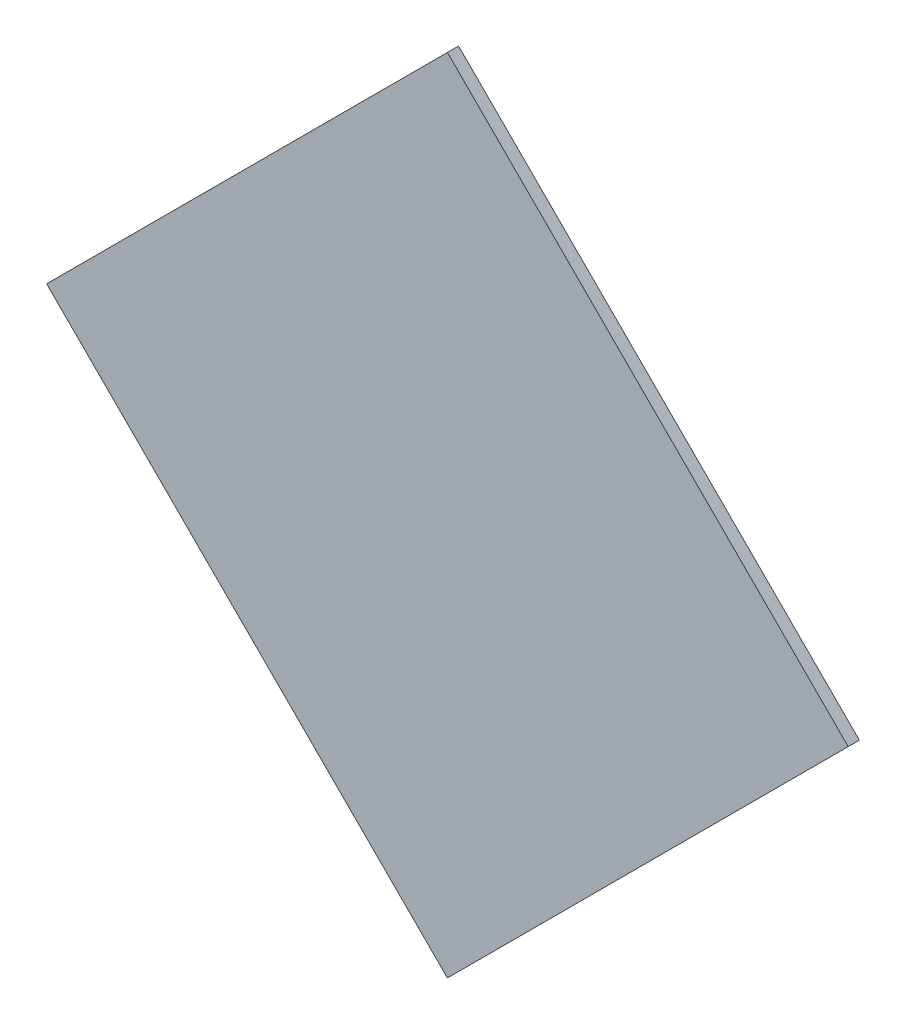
ISO-10303-21;
HEADER;
FILE_DESCRIPTION(('STEP AP214'),'2;1');
FILE_NAME('part.step','',(''),(''),'','','');
FILE_SCHEMA(('AUTOMOTIVE_DESIGN { 1 0 10303 214 1 1 1 1 }'));
ENDSEC;
DATA;
#1=APPLICATION_CONTEXT('core data for automotive mechanical design processes');
#2=APPLICATION_PROTOCOL_DEFINITION('international standard','automotive_design',2000,#1);
#3=PRODUCT_CONTEXT('',#1,'mechanical');
#4=PRODUCT('Part','Part','',(#3));
#5=PRODUCT_RELATED_PRODUCT_CATEGORY('part','',(#4));
#6=PRODUCT_DEFINITION_FORMATION('','',#4);
#7=PRODUCT_DEFINITION_CONTEXT('part definition',#1,'design');
#8=PRODUCT_DEFINITION('design','',#6,#7);
#9=PRODUCT_DEFINITION_SHAPE('','',#8);
#10=(LENGTH_UNIT() NAMED_UNIT(*) SI_UNIT(.MILLI.,.METRE.));
#11=(NAMED_UNIT(*) PLANE_ANGLE_UNIT() SI_UNIT($,.RADIAN.));
#12=(NAMED_UNIT(*) SI_UNIT($,.STERADIAN.) SOLID_ANGLE_UNIT());
#13=UNCERTAINTY_MEASURE_WITH_UNIT(LENGTH_MEASURE(1.E-05),#10,'distance_accuracy_value','');
#14=(GEOMETRIC_REPRESENTATION_CONTEXT(3) GLOBAL_UNCERTAINTY_ASSIGNED_CONTEXT((#13)) GLOBAL_UNIT_ASSIGNED_CONTEXT((#10,
#11,#12)) REPRESENTATION_CONTEXT('',''));
#15=CARTESIAN_POINT('',(0.,0.,0.));
#16=DIRECTION('',(0.,0.,1.));
#17=DIRECTION('',(1.,0.,0.));
#18=AXIS2_PLACEMENT_3D('',#15,#16,#17);
#19=CARTESIAN_POINT('',(5.079999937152E-06,0.3592068,0.));
#20=DIRECTION('',(0.707109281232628,0.707104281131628,0.));
#21=DIRECTION('',(0.,0.,-1.));
#22=AXIS2_PLACEMENT_3D('',#19,#20,#21);
#23=PLANE('',#22);
#24=DIRECTION('',(0.,0.,1.));
#25=VECTOR('',#24,1.);
#26=CARTESIAN_POINT('',(5.079999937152E-06,0.3592068,0.));
#27=LINE('',#26,#25);
#28=CARTESIAN_POINT('',(5.079999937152E-06,0.3592068,0.));
#29=VERTEX_POINT('',#28);
#30=CARTESIAN_POINT('',(5.079999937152E-06,0.3592068,0.00999998));
#31=VERTEX_POINT('',#30);
#32=EDGE_CURVE('E11',#29,#31,#27,.T.);
#33=ORIENTED_EDGE('',*,*,#32,.T.);
#34=DIRECTION('',(0.707104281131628,-0.707109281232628,0.));
#35=VECTOR('',#34,1.);
#36=CARTESIAN_POINT('',(5.079999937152E-06,0.3592068,0.00999998));
#37=LINE('',#36,#35);
#38=CARTESIAN_POINT('',(0.3592068,2.540000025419E-06,0.00999998));
#39=VERTEX_POINT('',#38);
#40=EDGE_CURVE('E44',#31,#39,#37,.T.);
#41=ORIENTED_EDGE('',*,*,#40,.T.);
#42=DIRECTION('',(0.,0.,1.));
#43=VECTOR('',#42,1.);
#44=CARTESIAN_POINT('',(0.3592068,2.540000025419E-06,0.));
#45=LINE('',#44,#43);
#46=CARTESIAN_POINT('',(0.3592068,2.540000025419E-06,0.));
#47=VERTEX_POINT('',#46);
#48=EDGE_CURVE('E78',#47,#39,#45,.T.);
#49=ORIENTED_EDGE('',*,*,#48,.F.);
#50=DIRECTION('',(0.707104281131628,-0.707109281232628,0.));
#51=VECTOR('',#50,1.);
#52=CARTESIAN_POINT('',(5.079999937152E-06,0.3592068,0.));
#53=LINE('',#52,#51);
#54=EDGE_CURVE('E108',#29,#47,#53,.T.);
#55=ORIENTED_EDGE('',*,*,#54,.F.);
#56=EDGE_LOOP('',(#33,#41,#49,#55));
#57=FACE_BOUND('',#56,.T.);
#58=ADVANCED_FACE('F17',(#57),#23,.T.);
#59=CARTESIAN_POINT('',(-0.35920426,0.,0.));
#60=DIRECTION('',(-0.707104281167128,0.707109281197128,0.));
#61=DIRECTION('',(0.,0.,1.));
#62=AXIS2_PLACEMENT_3D('',#59,#60,#61);
#63=PLANE('',#62);
#64=DIRECTION('',(0.,0.,1.));
#65=VECTOR('',#64,1.);
#66=CARTESIAN_POINT('',(-0.35920426,0.,0.));
#67=LINE('',#66,#65);
#68=CARTESIAN_POINT('',(-0.35920426,0.,0.));
#69=VERTEX_POINT('',#68);
#70=CARTESIAN_POINT('',(-0.35920426,0.,0.00999998));
#71=VERTEX_POINT('',#70);
#72=EDGE_CURVE('E89',#69,#71,#67,.T.);
#73=ORIENTED_EDGE('',*,*,#72,.T.);
#74=DIRECTION('',(0.707109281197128,0.707104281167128,0.));
#75=VECTOR('',#74,1.);
#76=CARTESIAN_POINT('',(-0.35920426,0.,0.00999998));
#77=LINE('',#76,#75);
#78=EDGE_CURVE('E25',#71,#31,#77,.T.);
#79=ORIENTED_EDGE('',*,*,#78,.T.);
#80=ORIENTED_EDGE('',*,*,#32,.F.);
#81=DIRECTION('',(0.707109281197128,0.707104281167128,0.));
#82=VECTOR('',#81,1.);
#83=CARTESIAN_POINT('',(-0.35920426,0.,0.));
#84=LINE('',#83,#82);
#85=EDGE_CURVE('E102',#69,#29,#84,.T.);
#86=ORIENTED_EDGE('',*,*,#85,.F.);
#87=EDGE_LOOP('',(#73,#79,#80,#86));
#88=FACE_BOUND('',#87,.T.);
#89=ADVANCED_FACE('F123',(#88),#63,.T.);
#90=CARTESIAN_POINT('',(1.90500109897E-06,3.17496656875E-07,0.00999998));
#91=DIRECTION('',(0.,0.,-1.));
#92=DIRECTION('',(0.,-1.,0.));
#93=AXIS2_PLACEMENT_3D('',#90,#91,#92);
#94=PLANE('',#93);
#95=DIRECTION('',(-0.70710178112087,-0.70711178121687,0.));
#96=VECTOR('',#95,1.);
#97=CARTESIAN_POINT('',(0.3592068,2.540000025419E-06,0.00999998));
#98=LINE('',#97,#96);
#99=CARTESIAN_POINT('',(2.539999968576E-06,-0.3592068,0.00999998));
#100=VERTEX_POINT('',#99);
#101=EDGE_CURVE('E72',#39,#100,#98,.T.);
#102=ORIENTED_EDGE('',*,*,#101,.F.);
#103=ORIENTED_EDGE('',*,*,#40,.F.);
#104=ORIENTED_EDGE('',*,*,#78,.F.);
#105=DIRECTION('',(-0.707106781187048,0.707106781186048,0.));
#106=VECTOR('',#105,1.);
#107=CARTESIAN_POINT('',(2.539999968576E-06,-0.3592068,0.00999998));
#108=LINE('',#107,#106);
#109=EDGE_CURVE('E83',#100,#71,#108,.T.);
#110=ORIENTED_EDGE('',*,*,#109,.F.);
#111=EDGE_LOOP('',(#102,#103,#104,#110));
#112=FACE_BOUND('',#111,.T.);
#113=ADVANCED_FACE('F84',(#112),#94,.F.);
#114=CARTESIAN_POINT('',(0.3592068,2.540000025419E-06,0.));
#115=DIRECTION('',(0.70711178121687,-0.70710178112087,0.));
#116=DIRECTION('',(0.,0.,-1.));
#117=AXIS2_PLACEMENT_3D('',#114,#115,#116);
#118=PLANE('',#117);
#119=ORIENTED_EDGE('',*,*,#48,.T.);
#120=ORIENTED_EDGE('',*,*,#101,.T.);
#121=DIRECTION('',(0.,0.,1.));
#122=VECTOR('',#121,1.);
#123=CARTESIAN_POINT('',(2.539999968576E-06,-0.3592068,0.));
#124=LINE('',#123,#122);
#125=CARTESIAN_POINT('',(2.539999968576E-06,-0.3592068,0.));
#126=VERTEX_POINT('',#125);
#127=EDGE_CURVE('E77',#126,#100,#124,.T.);
#128=ORIENTED_EDGE('',*,*,#127,.F.);
#129=DIRECTION('',(-0.70710178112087,-0.70711178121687,0.));
#130=VECTOR('',#129,1.);
#131=CARTESIAN_POINT('',(0.3592068,2.540000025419E-06,0.));
#132=LINE('',#131,#130);
#133=EDGE_CURVE('E112',#47,#126,#132,.T.);
#134=ORIENTED_EDGE('',*,*,#133,.F.);
#135=EDGE_LOOP('',(#119,#120,#128,#134));
#136=FACE_BOUND('',#135,.T.);
#137=ADVANCED_FACE('F74',(#136),#118,.T.);
#138=CARTESIAN_POINT('',(1.90500109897E-06,3.17496656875E-07,0.));
#139=DIRECTION('',(0.,0.,-1.));
#140=DIRECTION('',(0.,-1.,0.));
#141=AXIS2_PLACEMENT_3D('',#138,#139,#140);
#142=PLANE('',#141);
#143=DIRECTION('',(-0.707106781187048,0.707106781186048,0.));
#144=VECTOR('',#143,1.);
#145=CARTESIAN_POINT('',(2.539999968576E-06,-0.3592068,0.));
#146=LINE('',#145,#144);
#147=EDGE_CURVE('E94',#126,#69,#146,.T.);
#148=ORIENTED_EDGE('',*,*,#147,.T.);
#149=ORIENTED_EDGE('',*,*,#85,.T.);
#150=ORIENTED_EDGE('',*,*,#54,.T.);
#151=ORIENTED_EDGE('',*,*,#133,.T.);
#152=EDGE_LOOP('',(#148,#149,#150,#151));
#153=FACE_BOUND('',#152,.T.);
#154=ADVANCED_FACE('F125',(#153),#142,.T.);
#155=CARTESIAN_POINT('',(2.539999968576E-06,-0.3592068,0.));
#156=DIRECTION('',(-0.707106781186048,-0.707106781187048,0.));
#157=DIRECTION('',(-0.707106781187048,0.707106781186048,0.));
#158=AXIS2_PLACEMENT_3D('',#155,#156,#157);
#159=PLANE('',#158);
#160=ORIENTED_EDGE('',*,*,#127,.T.);
#161=ORIENTED_EDGE('',*,*,#109,.T.);
#162=ORIENTED_EDGE('',*,*,#72,.F.);
#163=ORIENTED_EDGE('',*,*,#147,.F.);
#164=EDGE_LOOP('',(#160,#161,#162,#163));
#165=FACE_BOUND('',#164,.T.);
#166=ADVANCED_FACE('F92',(#165),#159,.T.);
#167=CLOSED_SHELL('',(#58,#89,#113,#137,#154,#166));
#168=MANIFOLD_SOLID_BREP('B1',#167);
#169=ADVANCED_BREP_SHAPE_REPRESENTATION('',(#18,#168),#14);
#170=SHAPE_DEFINITION_REPRESENTATION(#9,#169);
ENDSEC;
END-ISO-10303-21;
